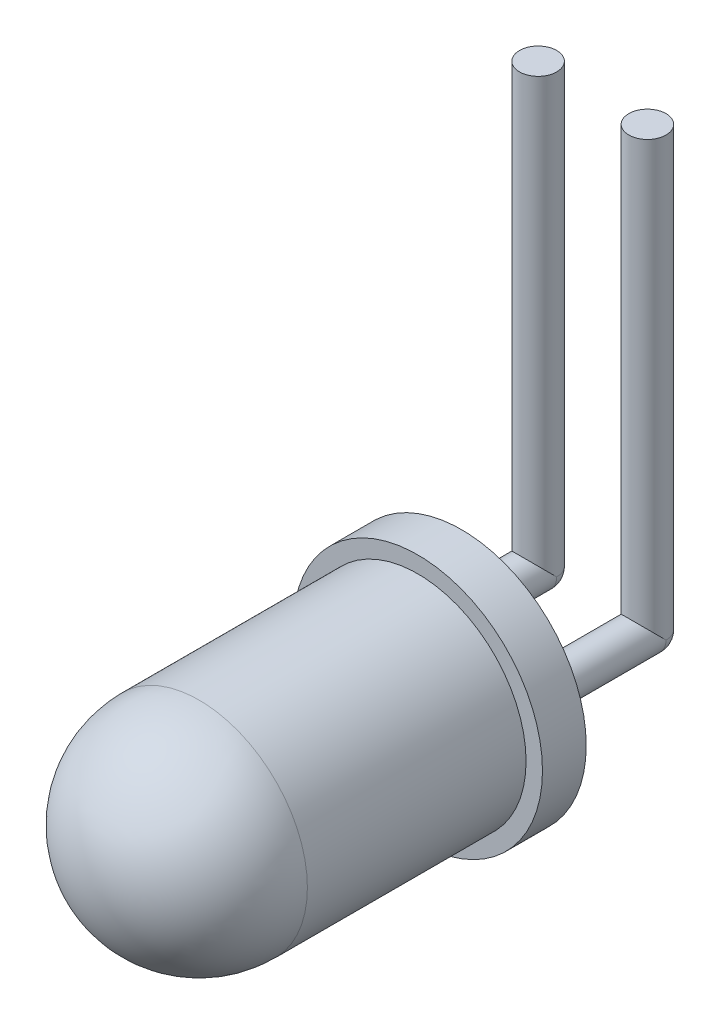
ISO-10303-21;
HEADER;
FILE_DESCRIPTION(('STEP AP214'),'2;1');
FILE_NAME('part.step','',(''),(''),'','','');
FILE_SCHEMA(('AUTOMOTIVE_DESIGN { 1 0 10303 214 1 1 1 1 }'));
ENDSEC;
DATA;
#1=APPLICATION_CONTEXT('core data for automotive mechanical design processes');
#2=APPLICATION_PROTOCOL_DEFINITION('international standard','automotive_design',2000,#1);
#3=PRODUCT_CONTEXT('',#1,'mechanical');
#4=PRODUCT('Part','Part','',(#3));
#5=PRODUCT_RELATED_PRODUCT_CATEGORY('part','',(#4));
#6=PRODUCT_DEFINITION_FORMATION('','',#4);
#7=PRODUCT_DEFINITION_CONTEXT('part definition',#1,'design');
#8=PRODUCT_DEFINITION('design','',#6,#7);
#9=PRODUCT_DEFINITION_SHAPE('','',#8);
#10=(LENGTH_UNIT() NAMED_UNIT(*) SI_UNIT(.MILLI.,.METRE.));
#11=(NAMED_UNIT(*) PLANE_ANGLE_UNIT() SI_UNIT($,.RADIAN.));
#12=(NAMED_UNIT(*) SI_UNIT($,.STERADIAN.) SOLID_ANGLE_UNIT());
#13=UNCERTAINTY_MEASURE_WITH_UNIT(LENGTH_MEASURE(1.E-05),#10,'distance_accuracy_value','');
#14=(GEOMETRIC_REPRESENTATION_CONTEXT(3) GLOBAL_UNCERTAINTY_ASSIGNED_CONTEXT((#13)) GLOBAL_UNIT_ASSIGNED_CONTEXT((#10,
#11,#12)) REPRESENTATION_CONTEXT('',''));
#15=CARTESIAN_POINT('',(0.,0.,0.));
#16=DIRECTION('',(0.,0.,1.));
#17=DIRECTION('',(1.,0.,0.));
#18=AXIS2_PLACEMENT_3D('',#15,#16,#17);
#19=CARTESIAN_POINT('',(1.27,0.,-3.048));
#20=DIRECTION('',(0.,0.,1.));
#21=DIRECTION('',(1.,0.,0.));
#22=AXIS2_PLACEMENT_3D('',#19,#20,#21);
#23=SPHERICAL_SURFACE('',#22,0.4318);
#24=CARTESIAN_POINT('',(1.27,0.,-3.048));
#25=DIRECTION('',(0.,0.,-1.));
#26=DIRECTION('',(-1.,0.,0.));
#27=AXIS2_PLACEMENT_3D('',#24,#25,#26);
#28=CIRCLE('',#27,0.4318);
#29=CARTESIAN_POINT('',(1.7018,0.,-3.048));
#30=VERTEX_POINT('',#29);
#31=CARTESIAN_POINT('',(0.8382,0.,-3.048));
#32=VERTEX_POINT('',#31);
#33=EDGE_CURVE('E13',#30,#32,#28,.T.);
#34=ORIENTED_EDGE('',*,*,#33,.T.);
#35=CARTESIAN_POINT('',(1.27,0.,-3.048));
#36=DIRECTION('',(0.,1.,0.));
#37=DIRECTION('',(0.,0.,1.));
#38=AXIS2_PLACEMENT_3D('',#35,#36,#37);
#39=CIRCLE('',#38,0.4318);
#40=EDGE_CURVE('E60',#30,#32,#39,.T.);
#41=ORIENTED_EDGE('',*,*,#40,.F.);
#42=EDGE_LOOP('',(#34,#41));
#43=FACE_BOUND('',#42,.T.);
#44=ADVANCED_FACE('F45',(#43),#23,.T.);
#45=CARTESIAN_POINT('',(1.27,0.,-3.048));
#46=DIRECTION('',(0.,0.,1.));
#47=DIRECTION('',(1.,0.,0.));
#48=AXIS2_PLACEMENT_3D('',#45,#46,#47);
#49=CYLINDRICAL_SURFACE('',#48,0.4318);
#50=ORIENTED_EDGE('',*,*,#33,.F.);
#51=CARTESIAN_POINT('',(1.27,0.,-3.048));
#52=DIRECTION('',(0.,-0.707106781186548,0.707106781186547));
#53=DIRECTION('',(0.,0.707106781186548,0.707106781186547));
#54=AXIS2_PLACEMENT_3D('',#51,#52,#53);
#55=ELLIPSE('',#54,0.610657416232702,0.4318);
#56=EDGE_CURVE('E58',#30,#32,#55,.T.);
#57=ORIENTED_EDGE('',*,*,#56,.T.);
#58=EDGE_LOOP('',(#50,#57));
#59=FACE_BOUND('',#58,.T.);
#60=CARTESIAN_POINT('',(1.27,0.,0.));
#61=DIRECTION('',(0.,0.,-1.));
#62=DIRECTION('',(-1.,0.,0.));
#63=AXIS2_PLACEMENT_3D('',#60,#61,#62);
#64=CIRCLE('',#63,0.4318);
#65=CARTESIAN_POINT('',(0.8382,0.,0.));
#66=VERTEX_POINT('',#65);
#67=EDGE_CURVE('E52',#66,#66,#64,.T.);
#68=ORIENTED_EDGE('',*,*,#67,.T.);
#69=EDGE_LOOP('',(#68));
#70=FACE_BOUND('',#69,.T.);
#71=ADVANCED_FACE('F67',(#59,#70),#49,.T.);
#72=CARTESIAN_POINT('',(1.27,0.,0.));
#73=DIRECTION('',(0.,0.,-1.));
#74=DIRECTION('',(-1.,0.,0.));
#75=AXIS2_PLACEMENT_3D('',#72,#73,#74);
#76=PLANE('',#75);
#77=ORIENTED_EDGE('',*,*,#67,.F.);
#78=EDGE_LOOP('',(#77));
#79=FACE_BOUND('',#78,.T.);
#80=ADVANCED_FACE('F74',(#79),#76,.F.);
#81=CARTESIAN_POINT('',(1.27,0.,-3.048));
#82=DIRECTION('',(0.,1.,0.));
#83=DIRECTION('',(0.,0.,1.));
#84=AXIS2_PLACEMENT_3D('',#81,#82,#83);
#85=CYLINDRICAL_SURFACE('',#84,0.4318);
#86=CARTESIAN_POINT('',(1.27,10.16,-3.048));
#87=DIRECTION('',(0.,1.,0.));
#88=DIRECTION('',(0.,0.,1.));
#89=AXIS2_PLACEMENT_3D('',#86,#87,#88);
#90=CIRCLE('',#89,0.4318);
#91=CARTESIAN_POINT('',(1.27,10.16,-2.6162));
#92=VERTEX_POINT('',#91);
#93=EDGE_CURVE('E64',#92,#92,#90,.T.);
#94=ORIENTED_EDGE('',*,*,#93,.F.);
#95=EDGE_LOOP('',(#94));
#96=FACE_BOUND('',#95,.T.);
#97=ORIENTED_EDGE('',*,*,#56,.F.);
#98=ORIENTED_EDGE('',*,*,#40,.T.);
#99=EDGE_LOOP('',(#97,#98));
#100=FACE_BOUND('',#99,.T.);
#101=ADVANCED_FACE('F61',(#96,#100),#85,.T.);
#102=CARTESIAN_POINT('',(-13.8771569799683,10.16,-3.048));
#103=DIRECTION('',(0.,1.,0.));
#104=DIRECTION('',(0.,0.,1.));
#105=AXIS2_PLACEMENT_3D('',#102,#103,#104);
#106=PLANE('',#105);
#107=ORIENTED_EDGE('',*,*,#93,.T.);
#108=EDGE_LOOP('',(#107));
#109=FACE_BOUND('',#108,.T.);
#110=ADVANCED_FACE('F81',(#109),#106,.T.);
#111=CLOSED_SHELL('',(#44,#71,#80,#101,#110));
#112=MANIFOLD_SOLID_BREP('B2',#111);
#113=CARTESIAN_POINT('',(-1.27,0.,-3.048));
#114=DIRECTION('',(0.,0.,1.));
#115=DIRECTION('',(1.,0.,0.));
#116=AXIS2_PLACEMENT_3D('',#113,#114,#115);
#117=SPHERICAL_SURFACE('',#116,0.4318);
#118=CARTESIAN_POINT('',(-1.27,0.,-3.048));
#119=DIRECTION('',(0.,0.,-1.));
#120=DIRECTION('',(-1.,0.,0.));
#121=AXIS2_PLACEMENT_3D('',#118,#119,#120);
#122=CIRCLE('',#121,0.4318);
#123=CARTESIAN_POINT('',(-0.8382,0.,-3.048));
#124=VERTEX_POINT('',#123);
#125=CARTESIAN_POINT('',(-1.7018,0.,-3.048));
#126=VERTEX_POINT('',#125);
#127=EDGE_CURVE('E43',#124,#126,#122,.T.);
#128=ORIENTED_EDGE('',*,*,#127,.T.);
#129=CARTESIAN_POINT('',(-1.27,0.,-3.048));
#130=DIRECTION('',(0.,1.,0.));
#131=DIRECTION('',(0.,0.,1.));
#132=AXIS2_PLACEMENT_3D('',#129,#130,#131);
#133=CIRCLE('',#132,0.4318);
#134=EDGE_CURVE('E142',#124,#126,#133,.T.);
#135=ORIENTED_EDGE('',*,*,#134,.F.);
#136=EDGE_LOOP('',(#128,#135));
#137=FACE_BOUND('',#136,.T.);
#138=ADVANCED_FACE('F127',(#137),#117,.T.);
#139=CARTESIAN_POINT('',(-1.27,0.,-3.048));
#140=DIRECTION('',(0.,0.,1.));
#141=DIRECTION('',(1.,0.,0.));
#142=AXIS2_PLACEMENT_3D('',#139,#140,#141);
#143=CYLINDRICAL_SURFACE('',#142,0.4318);
#144=ORIENTED_EDGE('',*,*,#127,.F.);
#145=CARTESIAN_POINT('',(-1.27,0.,-3.048));
#146=DIRECTION('',(0.,-0.707106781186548,0.707106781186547));
#147=DIRECTION('',(0.,0.707106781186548,0.707106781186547));
#148=AXIS2_PLACEMENT_3D('',#145,#146,#147);
#149=ELLIPSE('',#148,0.610657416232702,0.4318);
#150=EDGE_CURVE('E140',#124,#126,#149,.T.);
#151=ORIENTED_EDGE('',*,*,#150,.T.);
#152=EDGE_LOOP('',(#144,#151));
#153=FACE_BOUND('',#152,.T.);
#154=CARTESIAN_POINT('',(-1.27,0.,0.));
#155=DIRECTION('',(0.,0.,-1.));
#156=DIRECTION('',(-1.,0.,0.));
#157=AXIS2_PLACEMENT_3D('',#154,#155,#156);
#158=CIRCLE('',#157,0.4318);
#159=CARTESIAN_POINT('',(-1.7018,0.,0.));
#160=VERTEX_POINT('',#159);
#161=EDGE_CURVE('E134',#160,#160,#158,.T.);
#162=ORIENTED_EDGE('',*,*,#161,.T.);
#163=EDGE_LOOP('',(#162));
#164=FACE_BOUND('',#163,.T.);
#165=ADVANCED_FACE('F149',(#153,#164),#143,.T.);
#166=CARTESIAN_POINT('',(-1.27,0.,0.));
#167=DIRECTION('',(0.,0.,-1.));
#168=DIRECTION('',(-1.,0.,0.));
#169=AXIS2_PLACEMENT_3D('',#166,#167,#168);
#170=PLANE('',#169);
#171=ORIENTED_EDGE('',*,*,#161,.F.);
#172=EDGE_LOOP('',(#171));
#173=FACE_BOUND('',#172,.T.);
#174=ADVANCED_FACE('F156',(#173),#170,.F.);
#175=CARTESIAN_POINT('',(-1.27,0.,-3.048));
#176=DIRECTION('',(0.,1.,0.));
#177=DIRECTION('',(0.,0.,1.));
#178=AXIS2_PLACEMENT_3D('',#175,#176,#177);
#179=CYLINDRICAL_SURFACE('',#178,0.4318);
#180=CARTESIAN_POINT('',(-1.27,10.16,-3.048));
#181=DIRECTION('',(0.,1.,0.));
#182=DIRECTION('',(0.,0.,1.));
#183=AXIS2_PLACEMENT_3D('',#180,#181,#182);
#184=CIRCLE('',#183,0.4318);
#185=CARTESIAN_POINT('',(-1.27,10.16,-2.6162));
#186=VERTEX_POINT('',#185);
#187=EDGE_CURVE('E146',#186,#186,#184,.T.);
#188=ORIENTED_EDGE('',*,*,#187,.F.);
#189=EDGE_LOOP('',(#188));
#190=FACE_BOUND('',#189,.T.);
#191=ORIENTED_EDGE('',*,*,#150,.F.);
#192=ORIENTED_EDGE('',*,*,#134,.T.);
#193=EDGE_LOOP('',(#191,#192));
#194=FACE_BOUND('',#193,.T.);
#195=ADVANCED_FACE('F143',(#190,#194),#179,.T.);
#196=CARTESIAN_POINT('',(-16.4171569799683,10.16,-3.048));
#197=DIRECTION('',(0.,1.,0.));
#198=DIRECTION('',(0.,0.,1.));
#199=AXIS2_PLACEMENT_3D('',#196,#197,#198);
#200=PLANE('',#199);
#201=ORIENTED_EDGE('',*,*,#187,.T.);
#202=EDGE_LOOP('',(#201));
#203=FACE_BOUND('',#202,.T.);
#204=ADVANCED_FACE('F163',(#203),#200,.T.);
#205=CLOSED_SHELL('',(#138,#165,#174,#195,#204));
#206=MANIFOLD_SOLID_BREP('B7',#205);
#207=CARTESIAN_POINT('',(0.,0.,1.016));
#208=DIRECTION('',(0.,0.,1.));
#209=DIRECTION('',(1.,0.,0.));
#210=AXIS2_PLACEMENT_3D('',#207,#208,#209);
#211=PLANE('',#210);
#212=CARTESIAN_POINT('',(0.,0.,1.016));
#213=DIRECTION('',(0.,0.,1.));
#214=DIRECTION('',(1.,0.,0.));
#215=AXIS2_PLACEMENT_3D('',#212,#213,#214);
#216=CIRCLE('',#215,2.8956);
#217=CARTESIAN_POINT('',(2.8956,0.,1.016));
#218=VERTEX_POINT('',#217);
#219=EDGE_CURVE('E126',#218,#218,#216,.T.);
#220=ORIENTED_EDGE('',*,*,#219,.T.);
#221=EDGE_LOOP('',(#220));
#222=FACE_BOUND('',#221,.T.);
#223=CARTESIAN_POINT('',(0.,0.,1.016));
#224=DIRECTION('',(0.,0.,1.));
#225=DIRECTION('',(1.,0.,0.));
#226=AXIS2_PLACEMENT_3D('',#223,#224,#225);
#227=CIRCLE('',#226,2.5146);
#228=CARTESIAN_POINT('',(2.5146,0.,1.016));
#229=VERTEX_POINT('',#228);
#230=EDGE_CURVE('E216',#229,#229,#227,.T.);
#231=ORIENTED_EDGE('',*,*,#230,.F.);
#232=EDGE_LOOP('',(#231));
#233=FACE_BOUND('',#232,.T.);
#234=ADVANCED_FACE('F202',(#222,#233),#211,.T.);
#235=CARTESIAN_POINT('',(0.,0.,1.016));
#236=DIRECTION('',(0.,0.,-1.));
#237=DIRECTION('',(-1.,0.,0.));
#238=AXIS2_PLACEMENT_3D('',#235,#236,#237);
#239=CYLINDRICAL_SURFACE('',#238,2.8956);
#240=ORIENTED_EDGE('',*,*,#219,.F.);
#241=EDGE_LOOP('',(#240));
#242=FACE_BOUND('',#241,.T.);
#243=CARTESIAN_POINT('',(0.,0.,0.));
#244=DIRECTION('',(0.,0.,1.));
#245=DIRECTION('',(1.,0.,0.));
#246=AXIS2_PLACEMENT_3D('',#243,#244,#245);
#247=CIRCLE('',#246,2.8956);
#248=CARTESIAN_POINT('',(2.8956,0.,0.));
#249=VERTEX_POINT('',#248);
#250=EDGE_CURVE('E210',#249,#249,#247,.T.);
#251=ORIENTED_EDGE('',*,*,#250,.T.);
#252=EDGE_LOOP('',(#251));
#253=FACE_BOUND('',#252,.T.);
#254=ADVANCED_FACE('F232',(#242,#253),#239,.T.);
#255=CARTESIAN_POINT('',(0.,0.,0.));
#256=DIRECTION('',(0.,0.,1.));
#257=DIRECTION('',(1.,0.,0.));
#258=AXIS2_PLACEMENT_3D('',#255,#256,#257);
#259=PLANE('',#258);
#260=ORIENTED_EDGE('',*,*,#250,.F.);
#261=EDGE_LOOP('',(#260));
#262=FACE_BOUND('',#261,.T.);
#263=ADVANCED_FACE('F226',(#262),#259,.F.);
#264=CARTESIAN_POINT('',(0.,0.,6.096));
#265=DIRECTION('',(0.,0.,-1.));
#266=DIRECTION('',(-1.,0.,0.));
#267=AXIS2_PLACEMENT_3D('',#264,#265,#266);
#268=CYLINDRICAL_SURFACE('',#267,2.5146);
#269=CARTESIAN_POINT('',(0.,0.,6.096));
#270=DIRECTION('',(0.,0.,1.));
#271=DIRECTION('',(1.,0.,0.));
#272=AXIS2_PLACEMENT_3D('',#269,#270,#271);
#273=CIRCLE('',#272,2.5146);
#274=CARTESIAN_POINT('',(2.5146,0.,6.096));
#275=VERTEX_POINT('',#274);
#276=EDGE_CURVE('E206',#275,#275,#273,.T.);
#277=ORIENTED_EDGE('',*,*,#276,.F.);
#278=EDGE_LOOP('',(#277));
#279=FACE_BOUND('',#278,.T.);
#280=ORIENTED_EDGE('',*,*,#230,.T.);
#281=EDGE_LOOP('',(#280));
#282=FACE_BOUND('',#281,.T.);
#283=ADVANCED_FACE('F224',(#279,#282),#268,.T.);
#284=CARTESIAN_POINT('',(0.,0.,6.096));
#285=DIRECTION('',(0.,0.,1.));
#286=DIRECTION('',(1.,0.,0.));
#287=AXIS2_PLACEMENT_3D('',#284,#285,#286);
#288=SPHERICAL_SURFACE('',#287,2.5146);
#289=ORIENTED_EDGE('',*,*,#276,.T.);
#290=EDGE_LOOP('',(#289));
#291=FACE_BOUND('',#290,.T.);
#292=ADVANCED_FACE('F204',(#291),#288,.T.);
#293=CLOSED_SHELL('',(#234,#254,#263,#283,#292));
#294=MANIFOLD_SOLID_BREP('B37',#293);
#295=ADVANCED_BREP_SHAPE_REPRESENTATION('',(#18,#112,#206,#294),#14);
#296=SHAPE_DEFINITION_REPRESENTATION(#9,#295);
ENDSEC;
END-ISO-10303-21;
